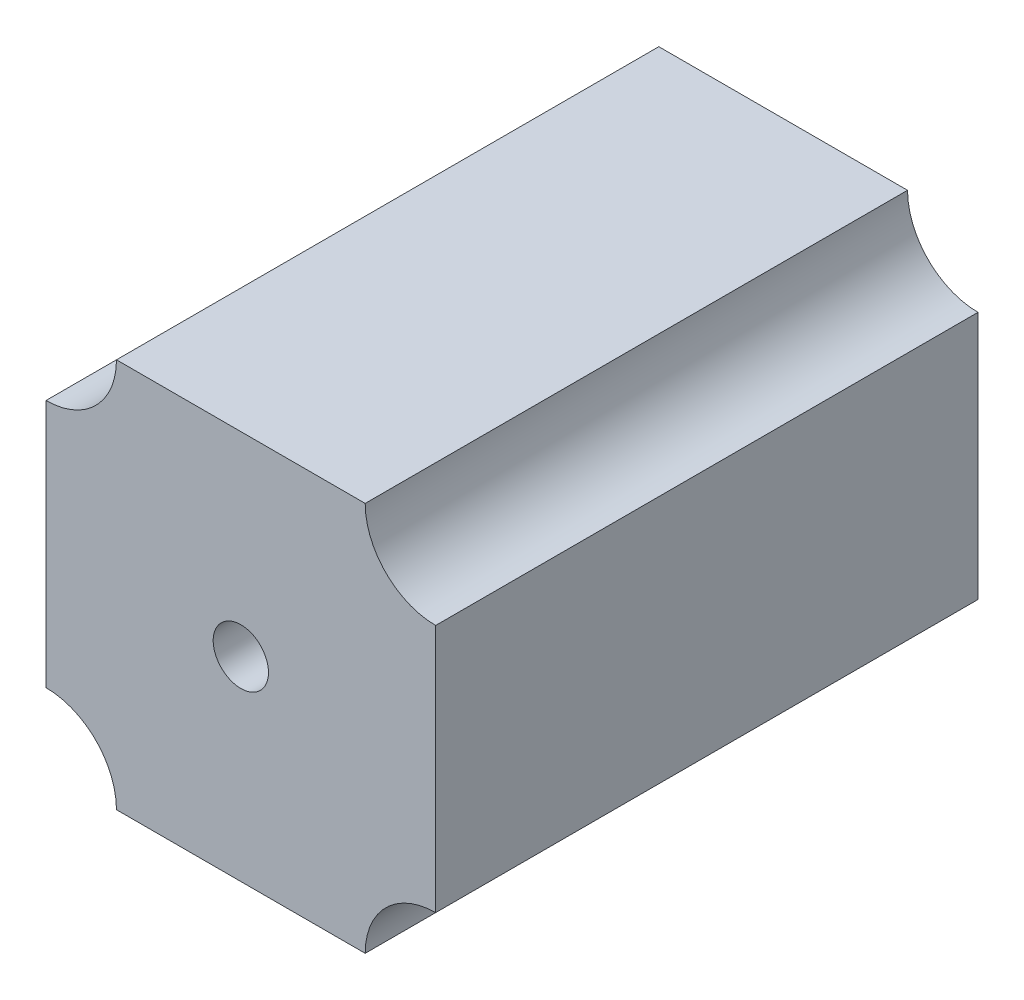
ISO-10303-21;
HEADER;
FILE_DESCRIPTION(('STEP AP214'),'2;1');
FILE_NAME('part.step','',(''),(''),'','','');
FILE_SCHEMA(('AUTOMOTIVE_DESIGN { 1 0 10303 214 1 1 1 1 }'));
ENDSEC;
DATA;
#1=APPLICATION_CONTEXT('core data for automotive mechanical design processes');
#2=APPLICATION_PROTOCOL_DEFINITION('international standard','automotive_design',2000,#1);
#3=PRODUCT_CONTEXT('',#1,'mechanical');
#4=PRODUCT('Part','Part','',(#3));
#5=PRODUCT_RELATED_PRODUCT_CATEGORY('part','',(#4));
#6=PRODUCT_DEFINITION_FORMATION('','',#4);
#7=PRODUCT_DEFINITION_CONTEXT('part definition',#1,'design');
#8=PRODUCT_DEFINITION('design','',#6,#7);
#9=PRODUCT_DEFINITION_SHAPE('','',#8);
#10=(LENGTH_UNIT() NAMED_UNIT(*) SI_UNIT(.MILLI.,.METRE.));
#11=(NAMED_UNIT(*) PLANE_ANGLE_UNIT() SI_UNIT($,.RADIAN.));
#12=(NAMED_UNIT(*) SI_UNIT($,.STERADIAN.) SOLID_ANGLE_UNIT());
#13=UNCERTAINTY_MEASURE_WITH_UNIT(LENGTH_MEASURE(1.E-05),#10,'distance_accuracy_value','');
#14=(GEOMETRIC_REPRESENTATION_CONTEXT(3) GLOBAL_UNCERTAINTY_ASSIGNED_CONTEXT((#13)) GLOBAL_UNIT_ASSIGNED_CONTEXT((#10,
#11,#12)) REPRESENTATION_CONTEXT('',''));
#15=CARTESIAN_POINT('',(0.,0.,0.));
#16=DIRECTION('',(0.,0.,1.));
#17=DIRECTION('',(1.,0.,0.));
#18=AXIS2_PLACEMENT_3D('',#15,#16,#17);
#19=CARTESIAN_POINT('',(-28.2,28.2,78.5));
#20=DIRECTION('',(0.,0.,-1.));
#21=DIRECTION('',(-1.,0.,0.));
#22=AXIS2_PLACEMENT_3D('',#19,#20,#21);
#23=CYLINDRICAL_SURFACE('',#22,10.2);
#24=CARTESIAN_POINT('',(-28.2,28.2,0.));
#25=DIRECTION('',(0.,0.,-1.));
#26=DIRECTION('',(1.,0.,0.));
#27=AXIS2_PLACEMENT_3D('',#24,#25,#26);
#28=CIRCLE('',#27,10.2);
#29=CARTESIAN_POINT('',(-18.,28.2,0.));
#30=VERTEX_POINT('',#29);
#31=CARTESIAN_POINT('',(-28.2,18.,0.));
#32=VERTEX_POINT('',#31);
#33=EDGE_CURVE('E129',#30,#32,#28,.T.);
#34=ORIENTED_EDGE('',*,*,#33,.T.);
#35=DIRECTION('',(0.,0.,-1.));
#36=VECTOR('',#35,1.);
#37=CARTESIAN_POINT('',(-28.2,18.,78.5));
#38=LINE('',#37,#36);
#39=CARTESIAN_POINT('',(-28.2,18.,78.5));
#40=VERTEX_POINT('',#39);
#41=EDGE_CURVE('E11',#40,#32,#38,.T.);
#42=ORIENTED_EDGE('',*,*,#41,.F.);
#43=CARTESIAN_POINT('',(-28.2,28.2,78.5));
#44=DIRECTION('',(0.,0.,-1.));
#45=DIRECTION('',(1.,0.,0.));
#46=AXIS2_PLACEMENT_3D('',#43,#44,#45);
#47=CIRCLE('',#46,10.2);
#48=CARTESIAN_POINT('',(-18.,28.2,78.5));
#49=VERTEX_POINT('',#48);
#50=EDGE_CURVE('E144',#49,#40,#47,.T.);
#51=ORIENTED_EDGE('',*,*,#50,.F.);
#52=DIRECTION('',(0.,0.,-1.));
#53=VECTOR('',#52,1.);
#54=CARTESIAN_POINT('',(-18.,28.2,78.5));
#55=LINE('',#54,#53);
#56=EDGE_CURVE('E125',#49,#30,#55,.T.);
#57=ORIENTED_EDGE('',*,*,#56,.T.);
#58=EDGE_LOOP('',(#34,#42,#51,#57));
#59=FACE_BOUND('',#58,.T.);
#60=ADVANCED_FACE('F33',(#59),#23,.F.);
#61=CARTESIAN_POINT('',(-28.2,-18.,78.5));
#62=DIRECTION('',(1.,0.,0.));
#63=DIRECTION('',(0.,0.,-1.));
#64=AXIS2_PLACEMENT_3D('',#61,#62,#63);
#65=PLANE('',#64);
#66=DIRECTION('',(0.,-1.,0.));
#67=VECTOR('',#66,1.);
#68=CARTESIAN_POINT('',(-28.2,-18.,0.));
#69=LINE('',#68,#67);
#70=CARTESIAN_POINT('',(-28.2,-18.,0.));
#71=VERTEX_POINT('',#70);
#72=EDGE_CURVE('E132',#32,#71,#69,.T.);
#73=ORIENTED_EDGE('',*,*,#72,.T.);
#74=DIRECTION('',(0.,0.,-1.));
#75=VECTOR('',#74,1.);
#76=CARTESIAN_POINT('',(-28.2,-18.,78.5));
#77=LINE('',#76,#75);
#78=CARTESIAN_POINT('',(-28.2,-18.,78.5));
#79=VERTEX_POINT('',#78);
#80=EDGE_CURVE('E41',#79,#71,#77,.T.);
#81=ORIENTED_EDGE('',*,*,#80,.F.);
#82=DIRECTION('',(0.,-1.,0.));
#83=VECTOR('',#82,1.);
#84=CARTESIAN_POINT('',(-28.2,-18.,78.5));
#85=LINE('',#84,#83);
#86=EDGE_CURVE('E92',#40,#79,#85,.T.);
#87=ORIENTED_EDGE('',*,*,#86,.F.);
#88=ORIENTED_EDGE('',*,*,#41,.T.);
#89=EDGE_LOOP('',(#73,#81,#87,#88));
#90=FACE_BOUND('',#89,.T.);
#91=ADVANCED_FACE('F200',(#90),#65,.F.);
#92=CARTESIAN_POINT('',(-28.2,-28.2,78.5));
#93=DIRECTION('',(0.,0.,-1.));
#94=DIRECTION('',(-1.,0.,0.));
#95=AXIS2_PLACEMENT_3D('',#92,#93,#94);
#96=CYLINDRICAL_SURFACE('',#95,10.2);
#97=CARTESIAN_POINT('',(-28.2,-28.2,0.));
#98=DIRECTION('',(0.,0.,-1.));
#99=DIRECTION('',(-1.,0.,0.));
#100=AXIS2_PLACEMENT_3D('',#97,#98,#99);
#101=CIRCLE('',#100,10.2);
#102=CARTESIAN_POINT('',(-18.,-28.2,0.));
#103=VERTEX_POINT('',#102);
#104=EDGE_CURVE('E135',#71,#103,#101,.T.);
#105=ORIENTED_EDGE('',*,*,#104,.T.);
#106=DIRECTION('',(0.,0.,-1.));
#107=VECTOR('',#106,1.);
#108=CARTESIAN_POINT('',(-18.,-28.2,78.5));
#109=LINE('',#108,#107);
#110=CARTESIAN_POINT('',(-18.,-28.2,78.5));
#111=VERTEX_POINT('',#110);
#112=EDGE_CURVE('E151',#111,#103,#109,.T.);
#113=ORIENTED_EDGE('',*,*,#112,.F.);
#114=CARTESIAN_POINT('',(-28.2,-28.2,78.5));
#115=DIRECTION('',(0.,0.,-1.));
#116=DIRECTION('',(-1.,0.,0.));
#117=AXIS2_PLACEMENT_3D('',#114,#115,#116);
#118=CIRCLE('',#117,10.2);
#119=EDGE_CURVE('E159',#79,#111,#118,.T.);
#120=ORIENTED_EDGE('',*,*,#119,.F.);
#121=ORIENTED_EDGE('',*,*,#80,.T.);
#122=EDGE_LOOP('',(#105,#113,#120,#121));
#123=FACE_BOUND('',#122,.T.);
#124=ADVANCED_FACE('F157',(#123),#96,.F.);
#125=CARTESIAN_POINT('',(18.,-28.2,78.5));
#126=DIRECTION('',(0.,1.,0.));
#127=DIRECTION('',(0.,0.,1.));
#128=AXIS2_PLACEMENT_3D('',#125,#126,#127);
#129=PLANE('',#128);
#130=DIRECTION('',(1.,0.,0.));
#131=VECTOR('',#130,1.);
#132=CARTESIAN_POINT('',(18.,-28.2,0.));
#133=LINE('',#132,#131);
#134=CARTESIAN_POINT('',(18.,-28.2,0.));
#135=VERTEX_POINT('',#134);
#136=EDGE_CURVE('E137',#103,#135,#133,.T.);
#137=ORIENTED_EDGE('',*,*,#136,.T.);
#138=DIRECTION('',(0.,0.,-1.));
#139=VECTOR('',#138,1.);
#140=CARTESIAN_POINT('',(18.,-28.2,78.5));
#141=LINE('',#140,#139);
#142=CARTESIAN_POINT('',(18.,-28.2,78.5));
#143=VERTEX_POINT('',#142);
#144=EDGE_CURVE('E148',#143,#135,#141,.T.);
#145=ORIENTED_EDGE('',*,*,#144,.F.);
#146=DIRECTION('',(1.,0.,0.));
#147=VECTOR('',#146,1.);
#148=CARTESIAN_POINT('',(18.,-28.2,78.5));
#149=LINE('',#148,#147);
#150=EDGE_CURVE('E171',#111,#143,#149,.T.);
#151=ORIENTED_EDGE('',*,*,#150,.F.);
#152=ORIENTED_EDGE('',*,*,#112,.T.);
#153=EDGE_LOOP('',(#137,#145,#151,#152));
#154=FACE_BOUND('',#153,.T.);
#155=ADVANCED_FACE('F167',(#154),#129,.F.);
#156=CARTESIAN_POINT('',(28.2,-28.2,78.5));
#157=DIRECTION('',(0.,0.,-1.));
#158=DIRECTION('',(-1.,0.,0.));
#159=AXIS2_PLACEMENT_3D('',#156,#157,#158);
#160=CYLINDRICAL_SURFACE('',#159,10.2);
#161=CARTESIAN_POINT('',(28.2,-28.2,0.));
#162=DIRECTION('',(0.,0.,-1.));
#163=DIRECTION('',(-1.,0.,0.));
#164=AXIS2_PLACEMENT_3D('',#161,#162,#163);
#165=CIRCLE('',#164,10.2);
#166=CARTESIAN_POINT('',(28.2,-18.,0.));
#167=VERTEX_POINT('',#166);
#168=EDGE_CURVE('E139',#135,#167,#165,.T.);
#169=ORIENTED_EDGE('',*,*,#168,.T.);
#170=DIRECTION('',(0.,0.,-1.));
#171=VECTOR('',#170,1.);
#172=CARTESIAN_POINT('',(28.2,-18.,78.5));
#173=LINE('',#172,#171);
#174=CARTESIAN_POINT('',(28.2,-18.,78.5));
#175=VERTEX_POINT('',#174);
#176=EDGE_CURVE('E120',#175,#167,#173,.T.);
#177=ORIENTED_EDGE('',*,*,#176,.F.);
#178=CARTESIAN_POINT('',(28.2,-28.2,78.5));
#179=DIRECTION('',(0.,0.,-1.));
#180=DIRECTION('',(-1.,0.,0.));
#181=AXIS2_PLACEMENT_3D('',#178,#179,#180);
#182=CIRCLE('',#181,10.2);
#183=EDGE_CURVE('E111',#143,#175,#182,.T.);
#184=ORIENTED_EDGE('',*,*,#183,.F.);
#185=ORIENTED_EDGE('',*,*,#144,.T.);
#186=EDGE_LOOP('',(#169,#177,#184,#185));
#187=FACE_BOUND('',#186,.T.);
#188=ADVANCED_FACE('F170',(#187),#160,.F.);
#189=CARTESIAN_POINT('',(28.2,-18.,78.5));
#190=DIRECTION('',(-1.,0.,0.));
#191=DIRECTION('',(0.,0.,1.));
#192=AXIS2_PLACEMENT_3D('',#189,#190,#191);
#193=PLANE('',#192);
#194=DIRECTION('',(0.,1.,0.));
#195=VECTOR('',#194,1.);
#196=CARTESIAN_POINT('',(28.2,-18.,0.));
#197=LINE('',#196,#195);
#198=CARTESIAN_POINT('',(28.2,18.,0.));
#199=VERTEX_POINT('',#198);
#200=EDGE_CURVE('E119',#167,#199,#197,.T.);
#201=ORIENTED_EDGE('',*,*,#200,.T.);
#202=DIRECTION('',(0.,0.,-1.));
#203=VECTOR('',#202,1.);
#204=CARTESIAN_POINT('',(28.2,18.,78.5));
#205=LINE('',#204,#203);
#206=CARTESIAN_POINT('',(28.2,18.,78.5));
#207=VERTEX_POINT('',#206);
#208=EDGE_CURVE('E116',#207,#199,#205,.T.);
#209=ORIENTED_EDGE('',*,*,#208,.F.);
#210=DIRECTION('',(0.,1.,0.));
#211=VECTOR('',#210,1.);
#212=CARTESIAN_POINT('',(28.2,-18.,78.5));
#213=LINE('',#212,#211);
#214=EDGE_CURVE('E105',#175,#207,#213,.T.);
#215=ORIENTED_EDGE('',*,*,#214,.F.);
#216=ORIENTED_EDGE('',*,*,#176,.T.);
#217=EDGE_LOOP('',(#201,#209,#215,#216));
#218=FACE_BOUND('',#217,.T.);
#219=ADVANCED_FACE('F117',(#218),#193,.F.);
#220=CARTESIAN_POINT('',(28.2,28.2,78.5));
#221=DIRECTION('',(0.,0.,-1.));
#222=DIRECTION('',(-1.,0.,0.));
#223=AXIS2_PLACEMENT_3D('',#220,#221,#222);
#224=CYLINDRICAL_SURFACE('',#223,10.2);
#225=CARTESIAN_POINT('',(28.2,28.2,0.));
#226=DIRECTION('',(0.,0.,-1.));
#227=DIRECTION('',(1.,0.,0.));
#228=AXIS2_PLACEMENT_3D('',#225,#226,#227);
#229=CIRCLE('',#228,10.2);
#230=CARTESIAN_POINT('',(18.,28.2,0.));
#231=VERTEX_POINT('',#230);
#232=EDGE_CURVE('E78',#199,#231,#229,.T.);
#233=ORIENTED_EDGE('',*,*,#232,.T.);
#234=DIRECTION('',(0.,0.,-1.));
#235=VECTOR('',#234,1.);
#236=CARTESIAN_POINT('',(18.,28.2,78.5));
#237=LINE('',#236,#235);
#238=CARTESIAN_POINT('',(18.,28.2,78.5));
#239=VERTEX_POINT('',#238);
#240=EDGE_CURVE('E121',#239,#231,#237,.T.);
#241=ORIENTED_EDGE('',*,*,#240,.F.);
#242=CARTESIAN_POINT('',(28.2,28.2,78.5));
#243=DIRECTION('',(0.,0.,-1.));
#244=DIRECTION('',(1.,0.,0.));
#245=AXIS2_PLACEMENT_3D('',#242,#243,#244);
#246=CIRCLE('',#245,10.2);
#247=EDGE_CURVE('E109',#207,#239,#246,.T.);
#248=ORIENTED_EDGE('',*,*,#247,.F.);
#249=ORIENTED_EDGE('',*,*,#208,.T.);
#250=EDGE_LOOP('',(#233,#241,#248,#249));
#251=FACE_BOUND('',#250,.T.);
#252=ADVANCED_FACE('F123',(#251),#224,.F.);
#253=CARTESIAN_POINT('',(18.,28.2,78.5));
#254=DIRECTION('',(0.,-1.,0.));
#255=DIRECTION('',(0.,0.,-1.));
#256=AXIS2_PLACEMENT_3D('',#253,#254,#255);
#257=PLANE('',#256);
#258=DIRECTION('',(-1.,0.,0.));
#259=VECTOR('',#258,1.);
#260=CARTESIAN_POINT('',(18.,28.2,0.));
#261=LINE('',#260,#259);
#262=EDGE_CURVE('E84',#231,#30,#261,.T.);
#263=ORIENTED_EDGE('',*,*,#262,.T.);
#264=ORIENTED_EDGE('',*,*,#56,.F.);
#265=DIRECTION('',(-1.,0.,0.));
#266=VECTOR('',#265,1.);
#267=CARTESIAN_POINT('',(18.,28.2,78.5));
#268=LINE('',#267,#266);
#269=EDGE_CURVE('E49',#239,#49,#268,.T.);
#270=ORIENTED_EDGE('',*,*,#269,.F.);
#271=ORIENTED_EDGE('',*,*,#240,.T.);
#272=EDGE_LOOP('',(#263,#264,#270,#271));
#273=FACE_BOUND('',#272,.T.);
#274=ADVANCED_FACE('F191',(#273),#257,.F.);
#275=CARTESIAN_POINT('',(-28.2,28.2,78.5));
#276=DIRECTION('',(0.,0.,1.));
#277=DIRECTION('',(1.,0.,0.));
#278=AXIS2_PLACEMENT_3D('',#275,#276,#277);
#279=PLANE('',#278);
#280=CARTESIAN_POINT('',(0.,0.,78.5));
#281=DIRECTION('',(0.,0.,1.));
#282=DIRECTION('',(1.,0.,0.));
#283=AXIS2_PLACEMENT_3D('',#280,#281,#282);
#284=CIRCLE('',#283,4.);
#285=CARTESIAN_POINT('',(4.,0.,78.5));
#286=VERTEX_POINT('',#285);
#287=EDGE_CURVE('E177',#286,#286,#284,.T.);
#288=ORIENTED_EDGE('',*,*,#287,.F.);
#289=EDGE_LOOP('',(#288));
#290=FACE_BOUND('',#289,.T.);
#291=ORIENTED_EDGE('',*,*,#50,.T.);
#292=ORIENTED_EDGE('',*,*,#86,.T.);
#293=ORIENTED_EDGE('',*,*,#119,.T.);
#294=ORIENTED_EDGE('',*,*,#150,.T.);
#295=ORIENTED_EDGE('',*,*,#183,.T.);
#296=ORIENTED_EDGE('',*,*,#214,.T.);
#297=ORIENTED_EDGE('',*,*,#247,.T.);
#298=ORIENTED_EDGE('',*,*,#269,.T.);
#299=EDGE_LOOP('',(#291,#292,#293,#294,#295,#296,#297,#298));
#300=FACE_BOUND('',#299,.T.);
#301=ADVANCED_FACE('F107',(#290,#300),#279,.T.);
#302=CARTESIAN_POINT('',(-28.2,28.2,0.));
#303=DIRECTION('',(0.,0.,1.));
#304=DIRECTION('',(1.,0.,0.));
#305=AXIS2_PLACEMENT_3D('',#302,#303,#304);
#306=PLANE('',#305);
#307=CARTESIAN_POINT('',(0.,0.,0.));
#308=DIRECTION('',(0.,0.,1.));
#309=DIRECTION('',(1.,0.,0.));
#310=AXIS2_PLACEMENT_3D('',#307,#308,#309);
#311=CIRCLE('',#310,4.);
#312=CARTESIAN_POINT('',(4.,0.,0.));
#313=VERTEX_POINT('',#312);
#314=EDGE_CURVE('E133',#313,#313,#311,.T.);
#315=ORIENTED_EDGE('',*,*,#314,.T.);
#316=EDGE_LOOP('',(#315));
#317=FACE_BOUND('',#316,.T.);
#318=ORIENTED_EDGE('',*,*,#33,.F.);
#319=ORIENTED_EDGE('',*,*,#262,.F.);
#320=ORIENTED_EDGE('',*,*,#232,.F.);
#321=ORIENTED_EDGE('',*,*,#200,.F.);
#322=ORIENTED_EDGE('',*,*,#168,.F.);
#323=ORIENTED_EDGE('',*,*,#136,.F.);
#324=ORIENTED_EDGE('',*,*,#104,.F.);
#325=ORIENTED_EDGE('',*,*,#72,.F.);
#326=EDGE_LOOP('',(#318,#319,#320,#321,#322,#323,#324,#325));
#327=FACE_BOUND('',#326,.T.);
#328=ADVANCED_FACE('F163',(#317,#327),#306,.F.);
#329=CARTESIAN_POINT('',(0.,0.,0.));
#330=DIRECTION('',(0.,0.,1.));
#331=DIRECTION('',(1.,0.,0.));
#332=AXIS2_PLACEMENT_3D('',#329,#330,#331);
#333=CYLINDRICAL_SURFACE('',#332,4.);
#334=ORIENTED_EDGE('',*,*,#314,.F.);
#335=EDGE_LOOP('',(#334));
#336=FACE_BOUND('',#335,.T.);
#337=ORIENTED_EDGE('',*,*,#287,.T.);
#338=EDGE_LOOP('',(#337));
#339=FACE_BOUND('',#338,.T.);
#340=ADVANCED_FACE('F184',(#336,#339),#333,.F.);
#341=CLOSED_SHELL('',(#60,#91,#124,#155,#188,#219,#252,#274,#301,#328,#340));
#342=MANIFOLD_SOLID_BREP('B2',#341);
#343=ADVANCED_BREP_SHAPE_REPRESENTATION('',(#18,#342),#14);
#344=SHAPE_DEFINITION_REPRESENTATION(#9,#343);
ENDSEC;
END-ISO-10303-21;
